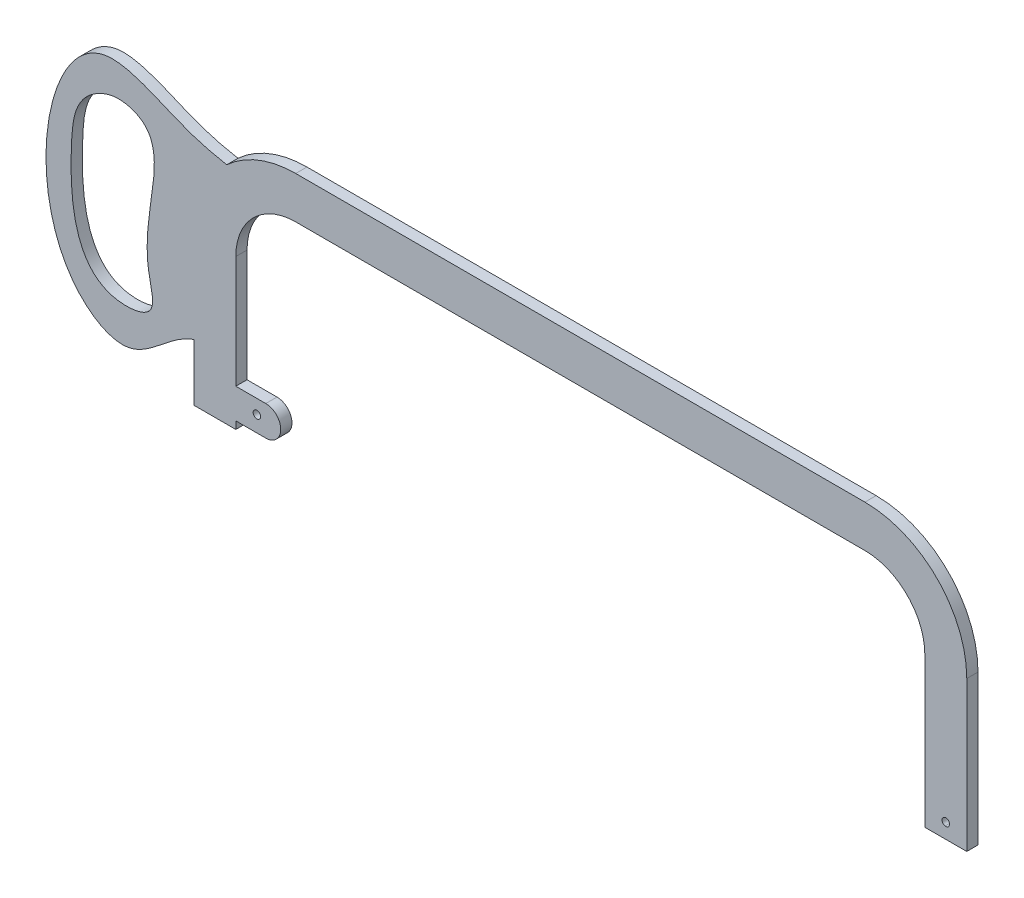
ISO-10303-21;
HEADER;
FILE_DESCRIPTION(('STEP AP214'),'2;1');
FILE_NAME('part.step','',(''),(''),'','','');
FILE_SCHEMA(('AUTOMOTIVE_DESIGN { 1 0 10303 214 1 1 1 1 }'));
ENDSEC;
DATA;
#1=APPLICATION_CONTEXT('core data for automotive mechanical design processes');
#2=APPLICATION_PROTOCOL_DEFINITION('international standard','automotive_design',2000,#1);
#3=PRODUCT_CONTEXT('',#1,'mechanical');
#4=PRODUCT('Part','Part','',(#3));
#5=PRODUCT_RELATED_PRODUCT_CATEGORY('part','',(#4));
#6=PRODUCT_DEFINITION_FORMATION('','',#4);
#7=PRODUCT_DEFINITION_CONTEXT('part definition',#1,'design');
#8=PRODUCT_DEFINITION('design','',#6,#7);
#9=PRODUCT_DEFINITION_SHAPE('','',#8);
#10=(LENGTH_UNIT() NAMED_UNIT(*) SI_UNIT(.MILLI.,.METRE.));
#11=(NAMED_UNIT(*) PLANE_ANGLE_UNIT() SI_UNIT($,.RADIAN.));
#12=(NAMED_UNIT(*) SI_UNIT($,.STERADIAN.) SOLID_ANGLE_UNIT());
#13=UNCERTAINTY_MEASURE_WITH_UNIT(LENGTH_MEASURE(1.E-05),#10,'distance_accuracy_value','');
#14=(GEOMETRIC_REPRESENTATION_CONTEXT(3) GLOBAL_UNCERTAINTY_ASSIGNED_CONTEXT((#13)) GLOBAL_UNIT_ASSIGNED_CONTEXT((#10,
#11,#12)) REPRESENTATION_CONTEXT('',''));
#15=CARTESIAN_POINT('',(0.,0.,0.));
#16=DIRECTION('',(0.,0.,1.));
#17=DIRECTION('',(1.,0.,0.));
#18=AXIS2_PLACEMENT_3D('',#15,#16,#17);
#19=CARTESIAN_POINT('',(124.737182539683,6.35,-2.38125));
#20=DIRECTION('',(0.,0.,1.));
#21=DIRECTION('',(1.,0.,0.));
#22=AXIS2_PLACEMENT_3D('',#19,#20,#21);
#23=CYLINDRICAL_SURFACE('',#22,1.58749999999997);
#24=CARTESIAN_POINT('',(124.737182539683,6.35,-2.38125));
#25=DIRECTION('',(0.,0.,1.));
#26=DIRECTION('',(1.,0.,0.));
#27=AXIS2_PLACEMENT_3D('',#24,#25,#26);
#28=CIRCLE('',#27,1.58749999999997);
#29=CARTESIAN_POINT('',(124.46,4.78688577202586,-2.38125));
#30=VERTEX_POINT('',#29);
#31=CARTESIAN_POINT('',(124.46,7.91311422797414,-2.38125));
#32=VERTEX_POINT('',#31);
#33=EDGE_CURVE('E297',#30,#32,#28,.T.);
#34=ORIENTED_EDGE('',*,*,#33,.F.);
#35=DIRECTION('',(0.,0.,1.));
#36=VECTOR('',#35,1.);
#37=CARTESIAN_POINT('',(124.46,4.78688577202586,-2.38125));
#38=LINE('',#37,#36);
#39=CARTESIAN_POINT('',(124.46,4.78688577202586,2.38125));
#40=VERTEX_POINT('',#39);
#41=EDGE_CURVE('E12',#30,#40,#38,.T.);
#42=ORIENTED_EDGE('',*,*,#41,.T.);
#43=CARTESIAN_POINT('',(124.737182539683,6.35,2.38125));
#44=DIRECTION('',(0.,0.,1.));
#45=DIRECTION('',(1.,0.,0.));
#46=AXIS2_PLACEMENT_3D('',#43,#44,#45);
#47=CIRCLE('',#46,1.58749999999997);
#48=CARTESIAN_POINT('',(124.46,7.91311422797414,2.38125));
#49=VERTEX_POINT('',#48);
#50=EDGE_CURVE('E441',#40,#49,#47,.T.);
#51=ORIENTED_EDGE('',*,*,#50,.T.);
#52=DIRECTION('',(0.,0.,-1.));
#53=VECTOR('',#52,1.);
#54=CARTESIAN_POINT('',(124.46,7.91311422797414,-2.38125));
#55=LINE('',#54,#53);
#56=EDGE_CURVE('E43',#49,#32,#55,.T.);
#57=ORIENTED_EDGE('',*,*,#56,.T.);
#58=EDGE_LOOP('',(#34,#42,#51,#57));
#59=FACE_BOUND('',#58,.T.);
#60=ADVANCED_FACE('F35',(#59),#23,.F.);
#61=CARTESIAN_POINT('',(-176.252817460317,0.,2.38125));
#62=DIRECTION('',(-1.,0.,0.));
#63=DIRECTION('',(0.,-1.,0.));
#64=AXIS2_PLACEMENT_3D('',#61,#62,#63);
#65=PLANE('',#64);
#66=DIRECTION('',(0.,1.,0.));
#67=VECTOR('',#66,1.);
#68=CARTESIAN_POINT('',(-176.252817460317,0.,-2.38125));
#69=LINE('',#68,#67);
#70=CARTESIAN_POINT('',(-176.252817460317,0.,-2.38125));
#71=VERTEX_POINT('',#70);
#72=CARTESIAN_POINT('',(-176.252817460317,3.175,-2.38125));
#73=VERTEX_POINT('',#72);
#74=EDGE_CURVE('E342',#71,#73,#69,.T.);
#75=ORIENTED_EDGE('',*,*,#74,.T.);
#76=DIRECTION('',(0.,0.,1.));
#77=VECTOR('',#76,1.);
#78=CARTESIAN_POINT('',(-176.252817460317,3.175,-25.2765005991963));
#79=LINE('',#78,#77);
#80=CARTESIAN_POINT('',(-176.252817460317,3.175,2.38125));
#81=VERTEX_POINT('',#80);
#82=EDGE_CURVE('E336',#73,#81,#79,.T.);
#83=ORIENTED_EDGE('',*,*,#82,.T.);
#84=DIRECTION('',(0.,1.,0.));
#85=VECTOR('',#84,1.);
#86=CARTESIAN_POINT('',(-176.252817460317,0.,2.38125));
#87=LINE('',#86,#85);
#88=CARTESIAN_POINT('',(-176.252817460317,0.,2.38125));
#89=VERTEX_POINT('',#88);
#90=EDGE_CURVE('E364',#89,#81,#87,.T.);
#91=ORIENTED_EDGE('',*,*,#90,.F.);
#92=DIRECTION('',(0.,0.,-1.));
#93=VECTOR('',#92,1.);
#94=CARTESIAN_POINT('',(-176.252817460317,0.,2.38125));
#95=LINE('',#94,#93);
#96=EDGE_CURVE('E416',#89,#71,#95,.T.);
#97=ORIENTED_EDGE('',*,*,#96,.T.);
#98=EDGE_LOOP('',(#75,#83,#91,#97));
#99=FACE_BOUND('',#98,.T.);
#100=ADVANCED_FACE('F286',(#99),#65,.F.);
#101=CARTESIAN_POINT('',(-194.032817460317,0.,2.38125));
#102=DIRECTION('',(0.,1.,0.));
#103=DIRECTION('',(0.,0.,1.));
#104=AXIS2_PLACEMENT_3D('',#101,#102,#103);
#105=PLANE('',#104);
#106=DIRECTION('',(1.,0.,0.));
#107=VECTOR('',#106,1.);
#108=CARTESIAN_POINT('',(-194.032817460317,0.,-2.38125));
#109=LINE('',#108,#107);
#110=CARTESIAN_POINT('',(-194.032817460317,0.,-2.38125));
#111=VERTEX_POINT('',#110);
#112=EDGE_CURVE('E171',#111,#71,#109,.T.);
#113=ORIENTED_EDGE('',*,*,#112,.T.);
#114=ORIENTED_EDGE('',*,*,#96,.F.);
#115=DIRECTION('',(1.,0.,0.));
#116=VECTOR('',#115,1.);
#117=CARTESIAN_POINT('',(-194.032817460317,0.,2.38125));
#118=LINE('',#117,#116);
#119=CARTESIAN_POINT('',(-194.032817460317,0.,2.38125));
#120=VERTEX_POINT('',#119);
#121=EDGE_CURVE('E175',#120,#89,#118,.T.);
#122=ORIENTED_EDGE('',*,*,#121,.F.);
#123=DIRECTION('',(0.,0.,-1.));
#124=VECTOR('',#123,1.);
#125=CARTESIAN_POINT('',(-194.032817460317,0.,2.38125));
#126=LINE('',#125,#124);
#127=EDGE_CURVE('E387',#120,#111,#126,.T.);
#128=ORIENTED_EDGE('',*,*,#127,.T.);
#129=EDGE_LOOP('',(#113,#114,#122,#128));
#130=FACE_BOUND('',#129,.T.);
#131=ADVANCED_FACE('F37',(#130),#105,.F.);
#132=CARTESIAN_POINT('',(-176.252817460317,15.875,2.38125));
#133=VERTEX_POINT('',#132);
#134=CARTESIAN_POINT('',(-176.252817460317,63.5,2.38125));
#135=VERTEX_POINT('',#134);
#136=EDGE_CURVE('E363',#133,#135,#87,.T.);
#137=ORIENTED_EDGE('',*,*,#136,.F.);
#138=DIRECTION('',(0.,0.,1.));
#139=VECTOR('',#138,1.);
#140=CARTESIAN_POINT('',(-176.252817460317,15.875,-25.2765005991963));
#141=LINE('',#140,#139);
#142=CARTESIAN_POINT('',(-176.252817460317,15.875,-2.38125));
#143=VERTEX_POINT('',#142);
#144=EDGE_CURVE('E329',#143,#133,#141,.T.);
#145=ORIENTED_EDGE('',*,*,#144,.F.);
#146=CARTESIAN_POINT('',(-176.252817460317,63.5,-2.38125));
#147=VERTEX_POINT('',#146);
#148=EDGE_CURVE('E341',#143,#147,#69,.T.);
#149=ORIENTED_EDGE('',*,*,#148,.T.);
#150=DIRECTION('',(0.,0.,-1.));
#151=VECTOR('',#150,1.);
#152=CARTESIAN_POINT('',(-176.252817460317,63.5,2.38125));
#153=LINE('',#152,#151);
#154=EDGE_CURVE('E413',#135,#147,#153,.T.);
#155=ORIENTED_EDGE('',*,*,#154,.F.);
#156=EDGE_LOOP('',(#137,#145,#149,#155));
#157=FACE_BOUND('',#156,.T.);
#158=ADVANCED_FACE('F282',(#157),#65,.F.);
#159=CARTESIAN_POINT('',(-150.852817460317,63.5,2.38125));
#160=DIRECTION('',(0.,0.,-1.));
#161=DIRECTION('',(-1.,0.,0.));
#162=AXIS2_PLACEMENT_3D('',#159,#160,#161);
#163=CYLINDRICAL_SURFACE('',#162,25.4);
#164=CARTESIAN_POINT('',(-150.852817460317,63.5,-2.38125));
#165=DIRECTION('',(0.,0.,-1.));
#166=DIRECTION('',(-1.,0.,0.));
#167=AXIS2_PLACEMENT_3D('',#164,#165,#166);
#168=CIRCLE('',#167,25.4);
#169=CARTESIAN_POINT('',(-150.852817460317,88.9,-2.38125));
#170=VERTEX_POINT('',#169);
#171=EDGE_CURVE('E344',#147,#170,#168,.T.);
#172=ORIENTED_EDGE('',*,*,#171,.T.);
#173=DIRECTION('',(0.,0.,-1.));
#174=VECTOR('',#173,1.);
#175=CARTESIAN_POINT('',(-150.852817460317,88.9,2.38125));
#176=LINE('',#175,#174);
#177=CARTESIAN_POINT('',(-150.852817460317,88.9,2.38125));
#178=VERTEX_POINT('',#177);
#179=EDGE_CURVE('E410',#178,#170,#176,.T.);
#180=ORIENTED_EDGE('',*,*,#179,.F.);
#181=CARTESIAN_POINT('',(-150.852817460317,63.5,2.38125));
#182=DIRECTION('',(0.,0.,-1.));
#183=DIRECTION('',(-1.,0.,0.));
#184=AXIS2_PLACEMENT_3D('',#181,#182,#183);
#185=CIRCLE('',#184,25.4);
#186=EDGE_CURVE('E367',#135,#178,#185,.T.);
#187=ORIENTED_EDGE('',*,*,#186,.F.);
#188=ORIENTED_EDGE('',*,*,#154,.T.);
#189=EDGE_LOOP('',(#172,#180,#187,#188));
#190=FACE_BOUND('',#189,.T.);
#191=ADVANCED_FACE('F279',(#190),#163,.F.);
#192=CARTESIAN_POINT('',(-150.852817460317,88.9,2.38125));
#193=DIRECTION('',(0.,1.,0.));
#194=DIRECTION('',(-1.,0.,0.));
#195=AXIS2_PLACEMENT_3D('',#192,#193,#194);
#196=PLANE('',#195);
#197=DIRECTION('',(1.,0.,0.));
#198=VECTOR('',#197,1.);
#199=CARTESIAN_POINT('',(-150.852817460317,88.9,-2.38125));
#200=LINE('',#199,#198);
#201=CARTESIAN_POINT('',(90.4471825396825,88.9,-2.38125));
#202=VERTEX_POINT('',#201);
#203=EDGE_CURVE('E346',#170,#202,#200,.T.);
#204=ORIENTED_EDGE('',*,*,#203,.T.);
#205=DIRECTION('',(0.,0.,-1.));
#206=VECTOR('',#205,1.);
#207=CARTESIAN_POINT('',(90.4471825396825,88.9,2.38125));
#208=LINE('',#207,#206);
#209=CARTESIAN_POINT('',(90.4471825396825,88.9,2.38125));
#210=VERTEX_POINT('',#209);
#211=EDGE_CURVE('E407',#210,#202,#208,.T.);
#212=ORIENTED_EDGE('',*,*,#211,.F.);
#213=DIRECTION('',(1.,0.,0.));
#214=VECTOR('',#213,1.);
#215=CARTESIAN_POINT('',(-150.852817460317,88.9,2.38125));
#216=LINE('',#215,#214);
#217=EDGE_CURVE('E369',#178,#210,#216,.T.);
#218=ORIENTED_EDGE('',*,*,#217,.F.);
#219=ORIENTED_EDGE('',*,*,#179,.T.);
#220=EDGE_LOOP('',(#204,#212,#218,#219));
#221=FACE_BOUND('',#220,.T.);
#222=ADVANCED_FACE('F275',(#221),#196,.F.);
#223=CARTESIAN_POINT('',(90.4471825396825,63.5,2.38125));
#224=DIRECTION('',(0.,0.,-1.));
#225=DIRECTION('',(-1.,0.,0.));
#226=AXIS2_PLACEMENT_3D('',#223,#224,#225);
#227=CYLINDRICAL_SURFACE('',#226,25.4);
#228=CARTESIAN_POINT('',(90.4471825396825,63.5,-2.38125));
#229=DIRECTION('',(0.,0.,-1.));
#230=DIRECTION('',(1.,0.,0.));
#231=AXIS2_PLACEMENT_3D('',#228,#229,#230);
#232=CIRCLE('',#231,25.4);
#233=CARTESIAN_POINT('',(115.847182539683,63.5,-2.38125));
#234=VERTEX_POINT('',#233);
#235=EDGE_CURVE('E348',#202,#234,#232,.T.);
#236=ORIENTED_EDGE('',*,*,#235,.T.);
#237=DIRECTION('',(0.,0.,-1.));
#238=VECTOR('',#237,1.);
#239=CARTESIAN_POINT('',(115.847182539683,63.5,2.38125));
#240=LINE('',#239,#238);
#241=CARTESIAN_POINT('',(115.847182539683,63.5,2.38125));
#242=VERTEX_POINT('',#241);
#243=EDGE_CURVE('E404',#242,#234,#240,.T.);
#244=ORIENTED_EDGE('',*,*,#243,.F.);
#245=CARTESIAN_POINT('',(90.4471825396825,63.5,2.38125));
#246=DIRECTION('',(0.,0.,-1.));
#247=DIRECTION('',(1.,0.,0.));
#248=AXIS2_PLACEMENT_3D('',#245,#246,#247);
#249=CIRCLE('',#248,25.4);
#250=EDGE_CURVE('E371',#210,#242,#249,.T.);
#251=ORIENTED_EDGE('',*,*,#250,.F.);
#252=ORIENTED_EDGE('',*,*,#211,.T.);
#253=EDGE_LOOP('',(#236,#244,#251,#252));
#254=FACE_BOUND('',#253,.T.);
#255=ADVANCED_FACE('F271',(#254),#227,.F.);
#256=CARTESIAN_POINT('',(115.847182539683,63.5,2.38125));
#257=DIRECTION('',(1.,0.,0.));
#258=DIRECTION('',(0.,0.,-1.));
#259=AXIS2_PLACEMENT_3D('',#256,#257,#258);
#260=PLANE('',#259);
#261=DIRECTION('',(0.,-1.,0.));
#262=VECTOR('',#261,1.);
#263=CARTESIAN_POINT('',(115.847182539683,63.5,-2.38125));
#264=LINE('',#263,#262);
#265=CARTESIAN_POINT('',(115.847182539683,0.,-2.38125));
#266=VERTEX_POINT('',#265);
#267=EDGE_CURVE('E350',#234,#266,#264,.T.);
#268=ORIENTED_EDGE('',*,*,#267,.T.);
#269=DIRECTION('',(0.,0.,-1.));
#270=VECTOR('',#269,1.);
#271=CARTESIAN_POINT('',(115.847182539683,0.,2.38125));
#272=LINE('',#271,#270);
#273=CARTESIAN_POINT('',(115.847182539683,0.,2.38125));
#274=VERTEX_POINT('',#273);
#275=EDGE_CURVE('E401',#274,#266,#272,.T.);
#276=ORIENTED_EDGE('',*,*,#275,.F.);
#277=DIRECTION('',(0.,-1.,0.));
#278=VECTOR('',#277,1.);
#279=CARTESIAN_POINT('',(115.847182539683,63.5,2.38125));
#280=LINE('',#279,#278);
#281=EDGE_CURVE('E373',#242,#274,#280,.T.);
#282=ORIENTED_EDGE('',*,*,#281,.F.);
#283=ORIENTED_EDGE('',*,*,#243,.T.);
#284=EDGE_LOOP('',(#268,#276,#282,#283));
#285=FACE_BOUND('',#284,.T.);
#286=ADVANCED_FACE('F267',(#285),#260,.F.);
#287=CARTESIAN_POINT('',(115.847182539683,0.,2.38125));
#288=DIRECTION('',(0.,1.,0.));
#289=DIRECTION('',(0.,0.,1.));
#290=AXIS2_PLACEMENT_3D('',#287,#288,#289);
#291=PLANE('',#290);
#292=DIRECTION('',(1.,0.,0.));
#293=VECTOR('',#292,1.);
#294=CARTESIAN_POINT('',(115.847182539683,0.,-2.38125));
#295=LINE('',#294,#293);
#296=CARTESIAN_POINT('',(133.627182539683,0.,-2.38125));
#297=VERTEX_POINT('',#296);
#298=EDGE_CURVE('E352',#266,#297,#295,.T.);
#299=ORIENTED_EDGE('',*,*,#298,.T.);
#300=DIRECTION('',(0.,0.,-1.));
#301=VECTOR('',#300,1.);
#302=CARTESIAN_POINT('',(133.627182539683,0.,2.38125));
#303=LINE('',#302,#301);
#304=CARTESIAN_POINT('',(133.627182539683,0.,2.38125));
#305=VERTEX_POINT('',#304);
#306=EDGE_CURVE('E398',#305,#297,#303,.T.);
#307=ORIENTED_EDGE('',*,*,#306,.F.);
#308=DIRECTION('',(1.,0.,0.));
#309=VECTOR('',#308,1.);
#310=CARTESIAN_POINT('',(115.847182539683,0.,2.38125));
#311=LINE('',#310,#309);
#312=EDGE_CURVE('E375',#274,#305,#311,.T.);
#313=ORIENTED_EDGE('',*,*,#312,.F.);
#314=ORIENTED_EDGE('',*,*,#275,.T.);
#315=EDGE_LOOP('',(#299,#307,#313,#314));
#316=FACE_BOUND('',#315,.T.);
#317=ADVANCED_FACE('F263',(#316),#291,.F.);
#318=CARTESIAN_POINT('',(133.627182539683,0.,2.38125));
#319=DIRECTION('',(-1.,0.,0.));
#320=DIRECTION('',(0.,0.,1.));
#321=AXIS2_PLACEMENT_3D('',#318,#319,#320);
#322=PLANE('',#321);
#323=DIRECTION('',(0.,1.,0.));
#324=VECTOR('',#323,1.);
#325=CARTESIAN_POINT('',(133.627182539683,0.,-2.38125));
#326=LINE('',#325,#324);
#327=CARTESIAN_POINT('',(133.627182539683,63.5,-2.38125));
#328=VERTEX_POINT('',#327);
#329=EDGE_CURVE('E354',#297,#328,#326,.T.);
#330=ORIENTED_EDGE('',*,*,#329,.T.);
#331=DIRECTION('',(0.,0.,-1.));
#332=VECTOR('',#331,1.);
#333=CARTESIAN_POINT('',(133.627182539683,63.5,2.38125));
#334=LINE('',#333,#332);
#335=CARTESIAN_POINT('',(133.627182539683,63.5,2.38125));
#336=VERTEX_POINT('',#335);
#337=EDGE_CURVE('E395',#336,#328,#334,.T.);
#338=ORIENTED_EDGE('',*,*,#337,.F.);
#339=DIRECTION('',(0.,1.,0.));
#340=VECTOR('',#339,1.);
#341=CARTESIAN_POINT('',(133.627182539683,0.,2.38125));
#342=LINE('',#341,#340);
#343=EDGE_CURVE('E377',#305,#336,#342,.T.);
#344=ORIENTED_EDGE('',*,*,#343,.F.);
#345=ORIENTED_EDGE('',*,*,#306,.T.);
#346=EDGE_LOOP('',(#330,#338,#344,#345));
#347=FACE_BOUND('',#346,.T.);
#348=ADVANCED_FACE('F259',(#347),#322,.F.);
#349=CARTESIAN_POINT('',(90.4471825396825,63.5,2.38125));
#350=DIRECTION('',(0.,0.,-1.));
#351=DIRECTION('',(-1.,0.,0.));
#352=AXIS2_PLACEMENT_3D('',#349,#350,#351);
#353=CYLINDRICAL_SURFACE('',#352,43.18);
#354=CARTESIAN_POINT('',(90.4471825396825,63.5,-2.38125));
#355=DIRECTION('',(0.,0.,1.));
#356=DIRECTION('',(1.,0.,0.));
#357=AXIS2_PLACEMENT_3D('',#354,#355,#356);
#358=CIRCLE('',#357,43.18);
#359=CARTESIAN_POINT('',(90.4471825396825,106.68,-2.38125));
#360=VERTEX_POINT('',#359);
#361=EDGE_CURVE('E356',#328,#360,#358,.T.);
#362=ORIENTED_EDGE('',*,*,#361,.T.);
#363=DIRECTION('',(0.,0.,-1.));
#364=VECTOR('',#363,1.);
#365=CARTESIAN_POINT('',(90.4471825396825,106.68,2.38125));
#366=LINE('',#365,#364);
#367=CARTESIAN_POINT('',(90.4471825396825,106.68,2.38125));
#368=VERTEX_POINT('',#367);
#369=EDGE_CURVE('E392',#368,#360,#366,.T.);
#370=ORIENTED_EDGE('',*,*,#369,.F.);
#371=CARTESIAN_POINT('',(90.4471825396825,63.5,2.38125));
#372=DIRECTION('',(0.,0.,1.));
#373=DIRECTION('',(1.,0.,0.));
#374=AXIS2_PLACEMENT_3D('',#371,#372,#373);
#375=CIRCLE('',#374,43.18);
#376=EDGE_CURVE('E379',#336,#368,#375,.T.);
#377=ORIENTED_EDGE('',*,*,#376,.F.);
#378=ORIENTED_EDGE('',*,*,#337,.T.);
#379=EDGE_LOOP('',(#362,#370,#377,#378));
#380=FACE_BOUND('',#379,.T.);
#381=ADVANCED_FACE('F255',(#380),#353,.T.);
#382=CARTESIAN_POINT('',(90.4471825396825,106.68,2.38125));
#383=DIRECTION('',(0.,-1.,0.));
#384=DIRECTION('',(1.,0.,0.));
#385=AXIS2_PLACEMENT_3D('',#382,#383,#384);
#386=PLANE('',#385);
#387=DIRECTION('',(-1.,0.,0.));
#388=VECTOR('',#387,1.);
#389=CARTESIAN_POINT('',(90.4471825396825,106.68,-2.38125));
#390=LINE('',#389,#388);
#391=CARTESIAN_POINT('',(-150.852817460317,106.68,-2.38125));
#392=VERTEX_POINT('',#391);
#393=EDGE_CURVE('E358',#360,#392,#390,.T.);
#394=ORIENTED_EDGE('',*,*,#393,.T.);
#395=DIRECTION('',(0.,0.,-1.));
#396=VECTOR('',#395,1.);
#397=CARTESIAN_POINT('',(-150.852817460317,106.68,2.38125));
#398=LINE('',#397,#396);
#399=CARTESIAN_POINT('',(-150.852817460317,106.68,2.38125));
#400=VERTEX_POINT('',#399);
#401=EDGE_CURVE('E389',#400,#392,#398,.T.);
#402=ORIENTED_EDGE('',*,*,#401,.F.);
#403=DIRECTION('',(-1.,0.,0.));
#404=VECTOR('',#403,1.);
#405=CARTESIAN_POINT('',(90.4471825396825,106.68,2.38125));
#406=LINE('',#405,#404);
#407=EDGE_CURVE('E381',#368,#400,#406,.T.);
#408=ORIENTED_EDGE('',*,*,#407,.F.);
#409=ORIENTED_EDGE('',*,*,#369,.T.);
#410=EDGE_LOOP('',(#394,#402,#408,#409));
#411=FACE_BOUND('',#410,.T.);
#412=ADVANCED_FACE('F251',(#411),#386,.F.);
#413=CARTESIAN_POINT('',(-150.852817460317,63.5,2.38125));
#414=DIRECTION('',(0.,0.,-1.));
#415=DIRECTION('',(-1.,0.,0.));
#416=AXIS2_PLACEMENT_3D('',#413,#414,#415);
#417=CYLINDRICAL_SURFACE('',#416,43.18);
#418=CARTESIAN_POINT('',(-150.852817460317,63.5,-2.38125));
#419=DIRECTION('',(0.,0.,1.));
#420=DIRECTION('',(-1.,0.,0.));
#421=AXIS2_PLACEMENT_3D('',#418,#419,#420);
#422=CIRCLE('',#421,43.18);
#423=CARTESIAN_POINT('',(-180.094894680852,95.2712656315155,-2.38125));
#424=VERTEX_POINT('',#423);
#425=EDGE_CURVE('E176',#392,#424,#422,.T.);
#426=ORIENTED_EDGE('',*,*,#425,.T.);
#427=DIRECTION('',(0.,0.,1.));
#428=VECTOR('',#427,1.);
#429=CARTESIAN_POINT('',(-180.094894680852,95.2712656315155,0.));
#430=LINE('',#429,#428);
#431=CARTESIAN_POINT('',(-180.094894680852,95.2712656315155,2.38125));
#432=VERTEX_POINT('',#431);
#433=EDGE_CURVE('E185',#424,#432,#430,.T.);
#434=ORIENTED_EDGE('',*,*,#433,.T.);
#435=CARTESIAN_POINT('',(-150.852817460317,63.5,2.38125));
#436=DIRECTION('',(0.,0.,1.));
#437=DIRECTION('',(-1.,0.,0.));
#438=AXIS2_PLACEMENT_3D('',#435,#436,#437);
#439=CIRCLE('',#438,43.18);
#440=EDGE_CURVE('E383',#400,#432,#439,.T.);
#441=ORIENTED_EDGE('',*,*,#440,.F.);
#442=ORIENTED_EDGE('',*,*,#401,.T.);
#443=EDGE_LOOP('',(#426,#434,#441,#442));
#444=FACE_BOUND('',#443,.T.);
#445=ADVANCED_FACE('F248',(#444),#417,.T.);
#446=CARTESIAN_POINT('',(-194.032817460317,63.5,2.38125));
#447=DIRECTION('',(1.,0.,0.));
#448=DIRECTION('',(0.,1.,0.));
#449=AXIS2_PLACEMENT_3D('',#446,#447,#448);
#450=PLANE('',#449);
#451=DIRECTION('',(0.,-1.,0.));
#452=VECTOR('',#451,1.);
#453=CARTESIAN_POINT('',(-194.032817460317,63.5,2.38125));
#454=LINE('',#453,#452);
#455=CARTESIAN_POINT('',(-194.032817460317,24.1205061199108,2.38125));
#456=VERTEX_POINT('',#455);
#457=EDGE_CURVE('E181',#456,#120,#454,.T.);
#458=ORIENTED_EDGE('',*,*,#457,.F.);
#459=DIRECTION('',(0.,0.,1.));
#460=VECTOR('',#459,1.);
#461=CARTESIAN_POINT('',(-194.032817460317,24.1205061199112,0.));
#462=LINE('',#461,#460);
#463=CARTESIAN_POINT('',(-194.032817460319,24.1205061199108,-2.38125));
#464=VERTEX_POINT('',#463);
#465=EDGE_CURVE('E179',#456,#464,#462,.F.);
#466=ORIENTED_EDGE('',*,*,#465,.T.);
#467=DIRECTION('',(0.,-1.,0.));
#468=VECTOR('',#467,1.);
#469=CARTESIAN_POINT('',(-194.032817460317,63.5,-2.38125));
#470=LINE('',#469,#468);
#471=EDGE_CURVE('E163',#464,#111,#470,.T.);
#472=ORIENTED_EDGE('',*,*,#471,.T.);
#473=ORIENTED_EDGE('',*,*,#127,.F.);
#474=EDGE_LOOP('',(#458,#466,#472,#473));
#475=FACE_BOUND('',#474,.T.);
#476=ADVANCED_FACE('F180',(#475),#450,.F.);
#477=CARTESIAN_POINT('',(-150.852817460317,63.5,2.38125));
#478=DIRECTION('',(0.,0.,-1.));
#479=DIRECTION('',(-1.,0.,0.));
#480=AXIS2_PLACEMENT_3D('',#477,#478,#479);
#481=PLANE('',#480);
#482=ORIENTED_EDGE('',*,*,#440,.T.);
#483=CARTESIAN_POINT('',(-163.50008603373,92.9767178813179,2.38125));
#484=CARTESIAN_POINT('',(-174.215818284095,94.2300992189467,2.38125));
#485=CARTESIAN_POINT('',(-196.776448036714,96.8689363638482,2.38125));
#486=CARTESIAN_POINT('',(-252.859222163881,130.124714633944,2.38125));
#487=CARTESIAN_POINT('',(-269.426470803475,29.793267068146,2.38125));
#488=CARTESIAN_POINT('',(-217.090656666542,-1.29085573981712,2.38125));
#489=CARTESIAN_POINT('',(-200.757769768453,26.3378115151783,2.38125));
#490=CARTESIAN_POINT('',(-186.899721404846,24.7198097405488,2.38125));
#491=CARTESIAN_POINT('',(-185.37100561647,24.541323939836,2.38125));
#492=B_SPLINE_CURVE_WITH_KNOTS('',3,(#483,#484,#485,#486,#487,#488,#489,#490,#491),
.UNSPECIFIED.,.F.,.F.,(4,1,1,1,1,1,4),(0.,0.145421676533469,0.306167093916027,0.711218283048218,
0.818840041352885,0.980015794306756,1.),.UNSPECIFIED.);
#493=EDGE_CURVE('E193',#432,#456,#492,.T.);
#494=ORIENTED_EDGE('',*,*,#493,.T.);
#495=ORIENTED_EDGE('',*,*,#457,.T.);
#496=ORIENTED_EDGE('',*,*,#121,.T.);
#497=ORIENTED_EDGE('',*,*,#90,.T.);
#498=DIRECTION('',(1.,0.,0.));
#499=VECTOR('',#498,1.);
#500=CARTESIAN_POINT('',(-176.252817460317,3.175,2.38125));
#501=LINE('',#500,#499);
#502=CARTESIAN_POINT('',(-163.552817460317,3.175,2.38125));
#503=VERTEX_POINT('',#502);
#504=EDGE_CURVE('E313',#81,#503,#501,.T.);
#505=ORIENTED_EDGE('',*,*,#504,.T.);
#506=CARTESIAN_POINT('',(-163.552817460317,9.525,2.38125));
#507=DIRECTION('',(0.,0.,1.));
#508=DIRECTION('',(1.,0.,0.));
#509=AXIS2_PLACEMENT_3D('',#506,#507,#508);
#510=CIRCLE('',#509,6.35);
#511=CARTESIAN_POINT('',(-163.552817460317,15.875,2.38125));
#512=VERTEX_POINT('',#511);
#513=EDGE_CURVE('E318',#503,#512,#510,.T.);
#514=ORIENTED_EDGE('',*,*,#513,.T.);
#515=DIRECTION('',(-1.,0.,0.));
#516=VECTOR('',#515,1.);
#517=CARTESIAN_POINT('',(-176.252817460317,15.875,2.38125));
#518=LINE('',#517,#516);
#519=EDGE_CURVE('E314',#512,#133,#518,.T.);
#520=ORIENTED_EDGE('',*,*,#519,.T.);
#521=ORIENTED_EDGE('',*,*,#136,.T.);
#522=ORIENTED_EDGE('',*,*,#186,.T.);
#523=ORIENTED_EDGE('',*,*,#217,.T.);
#524=ORIENTED_EDGE('',*,*,#250,.T.);
#525=ORIENTED_EDGE('',*,*,#281,.T.);
#526=ORIENTED_EDGE('',*,*,#312,.T.);
#527=ORIENTED_EDGE('',*,*,#343,.T.);
#528=ORIENTED_EDGE('',*,*,#376,.T.);
#529=ORIENTED_EDGE('',*,*,#407,.T.);
#530=EDGE_LOOP('',(#482,#494,#495,#496,#497,#505,#514,#520,#521,#522,#523,#524,#525,#526,#527,
#528,#529));
#531=FACE_BOUND('',#530,.T.);
#532=EDGE_CURVE('E301',#49,#40,#47,.T.);
#533=ORIENTED_EDGE('',*,*,#532,.F.);
#534=ORIENTED_EDGE('',*,*,#50,.F.);
#535=EDGE_LOOP('',(#533,#534));
#536=FACE_BOUND('',#535,.T.);
#537=CARTESIAN_POINT('',(-167.336278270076,9.93855216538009,2.38125));
#538=DIRECTION('',(0.,0.,1.));
#539=DIRECTION('',(1.,0.,0.));
#540=AXIS2_PLACEMENT_3D('',#537,#538,#539);
#541=CIRCLE('',#540,1.58749999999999);
#542=CARTESIAN_POINT('',(-165.748778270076,9.93855216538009,2.38125));
#543=VERTEX_POINT('',#542);
#544=EDGE_CURVE('E304',#543,#543,#541,.T.);
#545=ORIENTED_EDGE('',*,*,#544,.F.);
#546=EDGE_LOOP('',(#545));
#547=FACE_BOUND('',#546,.T.);
#548=CARTESIAN_POINT('',(-241.011953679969,88.8094623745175,2.38125));
#549=CARTESIAN_POINT('',(-244.988611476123,83.6487410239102,2.38125));
#550=CARTESIAN_POINT('',(-247.283551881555,60.1055409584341,2.38125));
#551=CARTESIAN_POINT('',(-244.915722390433,18.8537352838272,2.38125));
#552=CARTESIAN_POINT('',(-208.081682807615,23.1237234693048,2.38125));
#553=CARTESIAN_POINT('',(-220.297957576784,55.3931547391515,2.38125));
#554=CARTESIAN_POINT('',(-201.095560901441,90.7405361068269,2.38125));
#555=CARTESIAN_POINT('',(-229.023756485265,98.1268585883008,2.38125));
#556=CARTESIAN_POINT('',(-237.642234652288,93.1825268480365,2.38125));
#557=CARTESIAN_POINT('',(-241.011953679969,88.8094623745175,2.38125));
#558=B_SPLINE_CURVE_WITH_KNOTS('',3,(#548,#549,#550,#551,#552,#553,#554,#555,#556,#557),
.UNSPECIFIED.,.T.,.F.,(4,1,1,1,1,1,1,4),(0.,0.110817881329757,0.392381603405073,
0.47396519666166,0.559095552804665,0.859488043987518,0.906095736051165,1.),.UNSPECIFIED.);
#559=CARTESIAN_POINT('',(-241.011953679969,88.8094623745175,2.38125));
#560=VERTEX_POINT('',#559);
#561=EDGE_CURVE('E190',#560,#560,#558,.T.);
#562=ORIENTED_EDGE('',*,*,#561,.F.);
#563=EDGE_LOOP('',(#562));
#564=FACE_BOUND('',#563,.T.);
#565=ADVANCED_FACE('F242',(#531,#536,#547,#564),#481,.F.);
#566=CARTESIAN_POINT('',(-150.852817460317,63.5,-2.38125));
#567=DIRECTION('',(0.,0.,-1.));
#568=DIRECTION('',(-1.,0.,0.));
#569=AXIS2_PLACEMENT_3D('',#566,#567,#568);
#570=PLANE('',#569);
#571=ORIENTED_EDGE('',*,*,#471,.F.);
#572=CARTESIAN_POINT('',(-163.50008603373,92.9767178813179,-2.38125));
#573=CARTESIAN_POINT('',(-174.215818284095,94.2300992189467,-2.38125));
#574=CARTESIAN_POINT('',(-196.776448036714,96.8689363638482,-2.38125));
#575=CARTESIAN_POINT('',(-252.859222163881,130.124714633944,-2.38125));
#576=CARTESIAN_POINT('',(-269.426470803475,29.793267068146,-2.38125));
#577=CARTESIAN_POINT('',(-217.090656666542,-1.29085573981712,-2.38125));
#578=CARTESIAN_POINT('',(-200.757769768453,26.3378115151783,-2.38125));
#579=CARTESIAN_POINT('',(-186.899721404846,24.7198097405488,-2.38125));
#580=CARTESIAN_POINT('',(-185.37100561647,24.541323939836,-2.38125));
#581=B_SPLINE_CURVE_WITH_KNOTS('',3,(#572,#573,#574,#575,#576,#577,#578,#579,#580),
.UNSPECIFIED.,.F.,.F.,(4,1,1,1,1,1,4),(0.,0.145421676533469,0.306167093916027,0.711218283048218,
0.818840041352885,0.980015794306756,1.),.UNSPECIFIED.);
#582=EDGE_CURVE('E169',#424,#464,#581,.T.);
#583=ORIENTED_EDGE('',*,*,#582,.F.);
#584=ORIENTED_EDGE('',*,*,#425,.F.);
#585=ORIENTED_EDGE('',*,*,#393,.F.);
#586=ORIENTED_EDGE('',*,*,#361,.F.);
#587=ORIENTED_EDGE('',*,*,#329,.F.);
#588=ORIENTED_EDGE('',*,*,#298,.F.);
#589=ORIENTED_EDGE('',*,*,#267,.F.);
#590=ORIENTED_EDGE('',*,*,#235,.F.);
#591=ORIENTED_EDGE('',*,*,#203,.F.);
#592=ORIENTED_EDGE('',*,*,#171,.F.);
#593=ORIENTED_EDGE('',*,*,#148,.F.);
#594=DIRECTION('',(-1.,0.,0.));
#595=VECTOR('',#594,1.);
#596=CARTESIAN_POINT('',(-176.252817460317,15.875,-2.38125));
#597=LINE('',#596,#595);
#598=CARTESIAN_POINT('',(-163.552817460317,15.875,-2.38125));
#599=VERTEX_POINT('',#598);
#600=EDGE_CURVE('E326',#599,#143,#597,.T.);
#601=ORIENTED_EDGE('',*,*,#600,.F.);
#602=CARTESIAN_POINT('',(-163.552817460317,9.525,-2.38125));
#603=DIRECTION('',(0.,0.,-1.));
#604=DIRECTION('',(-1.,0.,0.));
#605=AXIS2_PLACEMENT_3D('',#602,#603,#604);
#606=CIRCLE('',#605,6.35);
#607=CARTESIAN_POINT('',(-163.552817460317,3.175,-2.38125));
#608=VERTEX_POINT('',#607);
#609=EDGE_CURVE('E331',#608,#599,#606,.F.);
#610=ORIENTED_EDGE('',*,*,#609,.F.);
#611=DIRECTION('',(1.,0.,0.));
#612=VECTOR('',#611,1.);
#613=CARTESIAN_POINT('',(-176.252817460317,3.175,-2.38125));
#614=LINE('',#613,#612);
#615=EDGE_CURVE('E317',#73,#608,#614,.T.);
#616=ORIENTED_EDGE('',*,*,#615,.F.);
#617=ORIENTED_EDGE('',*,*,#74,.F.);
#618=ORIENTED_EDGE('',*,*,#112,.F.);
#619=EDGE_LOOP('',(#571,#583,#584,#585,#586,#587,#588,#589,#590,#591,#592,#593,#601,#610,#616,
#617,#618));
#620=FACE_BOUND('',#619,.T.);
#621=EDGE_CURVE('E300',#32,#30,#28,.T.);
#622=ORIENTED_EDGE('',*,*,#621,.T.);
#623=ORIENTED_EDGE('',*,*,#33,.T.);
#624=EDGE_LOOP('',(#622,#623));
#625=FACE_BOUND('',#624,.T.);
#626=CARTESIAN_POINT('',(-167.336278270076,9.93855216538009,-2.38125));
#627=DIRECTION('',(0.,0.,1.));
#628=DIRECTION('',(1.,0.,0.));
#629=AXIS2_PLACEMENT_3D('',#626,#627,#628);
#630=CIRCLE('',#629,1.58749999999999);
#631=CARTESIAN_POINT('',(-165.748778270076,9.93855216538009,-2.38125));
#632=VERTEX_POINT('',#631);
#633=EDGE_CURVE('E306',#632,#632,#630,.T.);
#634=ORIENTED_EDGE('',*,*,#633,.T.);
#635=EDGE_LOOP('',(#634));
#636=FACE_BOUND('',#635,.T.);
#637=CARTESIAN_POINT('',(-241.011953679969,88.8094623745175,-2.38125));
#638=CARTESIAN_POINT('',(-244.988611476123,83.6487410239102,-2.38125));
#639=CARTESIAN_POINT('',(-247.283551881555,60.1055409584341,-2.38125));
#640=CARTESIAN_POINT('',(-244.915722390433,18.8537352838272,-2.38125));
#641=CARTESIAN_POINT('',(-208.081682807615,23.1237234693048,-2.38125));
#642=CARTESIAN_POINT('',(-220.297957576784,55.3931547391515,-2.38125));
#643=CARTESIAN_POINT('',(-201.095560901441,90.7405361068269,-2.38125));
#644=CARTESIAN_POINT('',(-229.023756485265,98.1268585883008,-2.38125));
#645=CARTESIAN_POINT('',(-237.642234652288,93.1825268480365,-2.38125));
#646=CARTESIAN_POINT('',(-241.011953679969,88.8094623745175,-2.38125));
#647=B_SPLINE_CURVE_WITH_KNOTS('',3,(#637,#638,#639,#640,#641,#642,#643,#644,#645,#646),
.UNSPECIFIED.,.T.,.F.,(4,1,1,1,1,1,1,4),(0.,0.110817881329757,0.392381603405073,
0.47396519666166,0.559095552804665,0.859488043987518,0.906095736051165,1.),.UNSPECIFIED.);
#648=CARTESIAN_POINT('',(-241.011953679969,88.8094623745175,-2.38125));
#649=VERTEX_POINT('',#648);
#650=EDGE_CURVE('E186',#649,#649,#647,.T.);
#651=ORIENTED_EDGE('',*,*,#650,.T.);
#652=EDGE_LOOP('',(#651));
#653=FACE_BOUND('',#652,.T.);
#654=ADVANCED_FACE('F165',(#620,#625,#636,#653),#570,.T.);
#655=CARTESIAN_POINT('',(-176.252817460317,3.175,-25.2765005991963));
#656=DIRECTION('',(0.,-1.,0.));
#657=DIRECTION('',(0.,0.,-1.));
#658=AXIS2_PLACEMENT_3D('',#655,#656,#657);
#659=PLANE('',#658);
#660=ORIENTED_EDGE('',*,*,#82,.F.);
#661=ORIENTED_EDGE('',*,*,#615,.T.);
#662=DIRECTION('',(0.,0.,1.));
#663=VECTOR('',#662,1.);
#664=CARTESIAN_POINT('',(-163.552817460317,3.175,-25.2765005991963));
#665=LINE('',#664,#663);
#666=EDGE_CURVE('E325',#608,#503,#665,.T.);
#667=ORIENTED_EDGE('',*,*,#666,.T.);
#668=ORIENTED_EDGE('',*,*,#504,.F.);
#669=EDGE_LOOP('',(#660,#661,#667,#668));
#670=FACE_BOUND('',#669,.T.);
#671=ADVANCED_FACE('F235',(#670),#659,.T.);
#672=CARTESIAN_POINT('',(-163.552817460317,9.525,-25.2765005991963));
#673=DIRECTION('',(0.,0.,1.));
#674=DIRECTION('',(1.,0.,0.));
#675=AXIS2_PLACEMENT_3D('',#672,#673,#674);
#676=CYLINDRICAL_SURFACE('',#675,6.35);
#677=ORIENTED_EDGE('',*,*,#666,.F.);
#678=ORIENTED_EDGE('',*,*,#609,.T.);
#679=DIRECTION('',(0.,0.,1.));
#680=VECTOR('',#679,1.);
#681=CARTESIAN_POINT('',(-163.552817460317,15.875,-25.2765005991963));
#682=LINE('',#681,#680);
#683=EDGE_CURVE('E330',#599,#512,#682,.T.);
#684=ORIENTED_EDGE('',*,*,#683,.T.);
#685=ORIENTED_EDGE('',*,*,#513,.F.);
#686=EDGE_LOOP('',(#677,#678,#684,#685));
#687=FACE_BOUND('',#686,.T.);
#688=ADVANCED_FACE('F231',(#687),#676,.T.);
#689=CARTESIAN_POINT('',(-176.252817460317,15.875,-25.2765005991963));
#690=DIRECTION('',(0.,1.,0.));
#691=DIRECTION('',(0.,0.,1.));
#692=AXIS2_PLACEMENT_3D('',#689,#690,#691);
#693=PLANE('',#692);
#694=ORIENTED_EDGE('',*,*,#683,.F.);
#695=ORIENTED_EDGE('',*,*,#600,.T.);
#696=ORIENTED_EDGE('',*,*,#144,.T.);
#697=ORIENTED_EDGE('',*,*,#519,.F.);
#698=EDGE_LOOP('',(#694,#695,#696,#697));
#699=FACE_BOUND('',#698,.T.);
#700=ADVANCED_FACE('F227',(#699),#693,.T.);
#701=CARTESIAN_POINT('',(-167.336278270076,9.93855216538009,-2.38125));
#702=DIRECTION('',(0.,0.,1.));
#703=DIRECTION('',(1.,0.,0.));
#704=AXIS2_PLACEMENT_3D('',#701,#702,#703);
#705=CYLINDRICAL_SURFACE('',#704,1.58749999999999);
#706=ORIENTED_EDGE('',*,*,#633,.F.);
#707=EDGE_LOOP('',(#706));
#708=FACE_BOUND('',#707,.T.);
#709=ORIENTED_EDGE('',*,*,#544,.T.);
#710=EDGE_LOOP('',(#709));
#711=FACE_BOUND('',#710,.T.);
#712=ADVANCED_FACE('F224',(#708,#711),#705,.F.);
#713=ORIENTED_EDGE('',*,*,#41,.F.);
#714=ORIENTED_EDGE('',*,*,#621,.F.);
#715=ORIENTED_EDGE('',*,*,#56,.F.);
#716=ORIENTED_EDGE('',*,*,#532,.T.);
#717=EDGE_LOOP('',(#713,#714,#715,#716));
#718=FACE_BOUND('',#717,.T.);
#719=ADVANCED_FACE('F218',(#718),#23,.F.);
#720=CARTESIAN_POINT('',(-163.50008603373,92.9767178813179,-143.124890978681));
#721=CARTESIAN_POINT('',(-174.215818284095,94.2300992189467,-143.124890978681));
#722=CARTESIAN_POINT('',(-196.776448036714,96.8689363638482,-143.124890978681));
#723=CARTESIAN_POINT('',(-252.859222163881,130.124714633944,-143.124890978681));
#724=CARTESIAN_POINT('',(-269.426470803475,29.793267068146,-143.124890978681));
#725=CARTESIAN_POINT('',(-217.090656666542,-1.29085573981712,-143.124890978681));
#726=CARTESIAN_POINT('',(-200.757769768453,26.3378115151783,-143.124890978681));
#727=CARTESIAN_POINT('',(-186.899721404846,24.7198097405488,-143.124890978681));
#728=CARTESIAN_POINT('',(-185.37100561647,24.541323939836,-143.124890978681));
#729=B_SPLINE_CURVE_WITH_KNOTS('',3,(#720,#721,#722,#723,#724,#725,#726,#727,#728),
.UNSPECIFIED.,.F.,.F.,(4,1,1,1,1,1,4),(0.,0.145421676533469,0.306167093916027,0.711218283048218,
0.818840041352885,0.980015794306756,1.),.UNSPECIFIED.);
#730=DIRECTION('',(0.,0.,1.));
#731=VECTOR('',#730,1.);
#732=SURFACE_OF_LINEAR_EXTRUSION('',#729,#731);
#733=ORIENTED_EDGE('',*,*,#433,.F.);
#734=ORIENTED_EDGE('',*,*,#582,.T.);
#735=ORIENTED_EDGE('',*,*,#465,.F.);
#736=ORIENTED_EDGE('',*,*,#493,.F.);
#737=EDGE_LOOP('',(#733,#734,#735,#736));
#738=FACE_BOUND('',#737,.T.);
#739=ADVANCED_FACE('F189',(#738),#732,.T.);
#740=CARTESIAN_POINT('',(-241.011953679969,88.8094623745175,-143.124890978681));
#741=CARTESIAN_POINT('',(-244.988611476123,83.6487410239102,-143.124890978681));
#742=CARTESIAN_POINT('',(-247.283551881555,60.1055409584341,-143.124890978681));
#743=CARTESIAN_POINT('',(-244.915722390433,18.8537352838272,-143.124890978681));
#744=CARTESIAN_POINT('',(-208.081682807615,23.1237234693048,-143.124890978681));
#745=CARTESIAN_POINT('',(-220.297957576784,55.3931547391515,-143.124890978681));
#746=CARTESIAN_POINT('',(-201.095560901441,90.7405361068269,-143.124890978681));
#747=CARTESIAN_POINT('',(-229.023756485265,98.1268585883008,-143.124890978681));
#748=CARTESIAN_POINT('',(-237.642234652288,93.1825268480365,-143.124890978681));
#749=CARTESIAN_POINT('',(-241.011953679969,88.8094623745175,-143.124890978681));
#750=B_SPLINE_CURVE_WITH_KNOTS('',3,(#740,#741,#742,#743,#744,#745,#746,#747,#748,#749),
.UNSPECIFIED.,.T.,.F.,(4,1,1,1,1,1,1,4),(0.,0.110817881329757,0.392381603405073,
0.47396519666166,0.559095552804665,0.859488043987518,0.906095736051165,1.),.UNSPECIFIED.);
#751=DIRECTION('',(0.,0.,1.));
#752=VECTOR('',#751,1.);
#753=SURFACE_OF_LINEAR_EXTRUSION('',#750,#752);
#754=ORIENTED_EDGE('',*,*,#561,.T.);
#755=EDGE_LOOP('',(#754));
#756=FACE_BOUND('',#755,.T.);
#757=ORIENTED_EDGE('',*,*,#650,.F.);
#758=EDGE_LOOP('',(#757));
#759=FACE_BOUND('',#758,.T.);
#760=ADVANCED_FACE('F217',(#756,#759),#753,.F.);
#761=CLOSED_SHELL('',(#60,#100,#131,#158,#191,#222,#255,#286,#317,#348,#381,#412,#445,#476,#565,
#654,#671,#688,#700,#712,#719,#739,#760));
#762=MANIFOLD_SOLID_BREP('B2',#761);
#763=ADVANCED_BREP_SHAPE_REPRESENTATION('',(#18,#762),#14);
#764=SHAPE_DEFINITION_REPRESENTATION(#9,#763);
ENDSEC;
END-ISO-10303-21;
